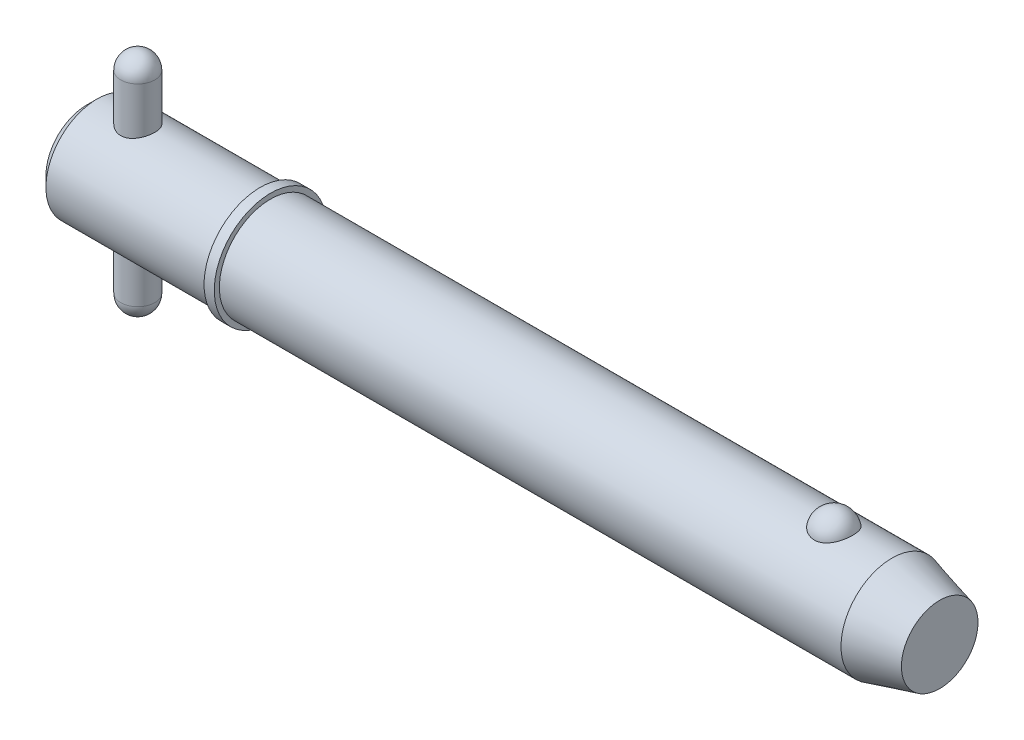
ISO-10303-21;
HEADER;
FILE_DESCRIPTION(('STEP AP214'),'2;1');
FILE_NAME('part.step','',(''),(''),'','','');
FILE_SCHEMA(('AUTOMOTIVE_DESIGN { 1 0 10303 214 1 1 1 1 }'));
ENDSEC;
DATA;
#1=APPLICATION_CONTEXT('core data for automotive mechanical design processes');
#2=APPLICATION_PROTOCOL_DEFINITION('international standard','automotive_design',2000,#1);
#3=PRODUCT_CONTEXT('',#1,'mechanical');
#4=PRODUCT('Part','Part','',(#3));
#5=PRODUCT_RELATED_PRODUCT_CATEGORY('part','',(#4));
#6=PRODUCT_DEFINITION_FORMATION('','',#4);
#7=PRODUCT_DEFINITION_CONTEXT('part definition',#1,'design');
#8=PRODUCT_DEFINITION('design','',#6,#7);
#9=PRODUCT_DEFINITION_SHAPE('','',#8);
#10=(LENGTH_UNIT() NAMED_UNIT(*) SI_UNIT(.MILLI.,.METRE.));
#11=(NAMED_UNIT(*) PLANE_ANGLE_UNIT() SI_UNIT($,.RADIAN.));
#12=(NAMED_UNIT(*) SI_UNIT($,.STERADIAN.) SOLID_ANGLE_UNIT());
#13=UNCERTAINTY_MEASURE_WITH_UNIT(LENGTH_MEASURE(1.E-05),#10,'distance_accuracy_value','');
#14=(GEOMETRIC_REPRESENTATION_CONTEXT(3) GLOBAL_UNCERTAINTY_ASSIGNED_CONTEXT((#13)) GLOBAL_UNIT_ASSIGNED_CONTEXT((#10,
#11,#12)) REPRESENTATION_CONTEXT('',''));
#15=CARTESIAN_POINT('',(0.,0.,0.));
#16=DIRECTION('',(0.,0.,1.));
#17=DIRECTION('',(1.,0.,0.));
#18=AXIS2_PLACEMENT_3D('',#15,#16,#17);
#19=CARTESIAN_POINT('',(7.14,15.875,0.));
#20=DIRECTION('',(0.,-1.,0.));
#21=DIRECTION('',(0.,0.,-1.));
#22=AXIS2_PLACEMENT_3D('',#19,#20,#21);
#23=CYLINDRICAL_SURFACE('',#22,2.38);
#24=CARTESIAN_POINT('',(7.14,-13.495,0.));
#25=DIRECTION('',(0.,-1.,0.));
#26=DIRECTION('',(0.,0.,-1.));
#27=AXIS2_PLACEMENT_3D('',#24,#25,#26);
#28=CIRCLE('',#27,2.38);
#29=CARTESIAN_POINT('',(7.14,-13.495,-2.38));
#30=VERTEX_POINT('',#29);
#31=EDGE_CURVE('P0_E10',#30,#30,#28,.F.);
#32=ORIENTED_EDGE('',*,*,#31,.T.);
#33=EDGE_LOOP('',(#32));
#34=FACE_BOUND('',#33,.T.);
#35=CARTESIAN_POINT('',(7.14,13.495,0.));
#36=DIRECTION('',(0.,-1.,0.));
#37=DIRECTION('',(0.,0.,-1.));
#38=AXIS2_PLACEMENT_3D('',#35,#36,#37);
#39=CIRCLE('',#38,2.38);
#40=CARTESIAN_POINT('',(7.14,13.495,-2.38));
#41=VERTEX_POINT('',#40);
#42=EDGE_CURVE('P0_E21',#41,#41,#39,.T.);
#43=ORIENTED_EDGE('',*,*,#42,.T.);
#44=EDGE_LOOP('',(#43));
#45=FACE_BOUND('',#44,.T.);
#46=ADVANCED_FACE('P0_F14',(#34,#45),#23,.T.);
#47=CARTESIAN_POINT('',(7.14,-13.495,0.));
#48=DIRECTION('',(0.,0.,1.));
#49=DIRECTION('',(1.,0.,0.));
#50=AXIS2_PLACEMENT_3D('',#47,#48,#49);
#51=SPHERICAL_SURFACE('',#50,2.38);
#52=CARTESIAN_POINT('',(7.14,-13.495,0.));
#53=DIRECTION('',(0.,-1.,0.));
#54=DIRECTION('',(0.,0.,-1.));
#55=AXIS2_PLACEMENT_3D('',#52,#53,#54);
#56=SPHERICAL_SURFACE('',#55,2.38);
#57=ORIENTED_EDGE('',*,*,#31,.F.);
#58=EDGE_LOOP('',(#57));
#59=FACE_BOUND('',#58,.T.);
#60=ADVANCED_FACE('P0_F29',(#59),#56,.T.);
#61=CARTESIAN_POINT('',(7.14,13.495,0.));
#62=DIRECTION('',(0.,0.,1.));
#63=DIRECTION('',(1.,0.,0.));
#64=AXIS2_PLACEMENT_3D('',#61,#62,#63);
#65=SPHERICAL_SURFACE('',#64,2.38);
#66=CARTESIAN_POINT('',(7.14,13.495,0.));
#67=DIRECTION('',(0.,-1.,0.));
#68=DIRECTION('',(0.,0.,-1.));
#69=AXIS2_PLACEMENT_3D('',#66,#67,#68);
#70=SPHERICAL_SURFACE('',#69,2.38);
#71=ORIENTED_EDGE('',*,*,#42,.F.);
#72=EDGE_LOOP('',(#71));
#73=FACE_BOUND('',#72,.T.);
#74=ADVANCED_FACE('P0_F16',(#73),#70,.T.);
#75=CLOSED_SHELL('',(#46,#60,#74));
#76=MANIFOLD_SOLID_BREP('P0_B1',#75);
#77=CARTESIAN_POINT('',(0.,0.,0.));
#78=DIRECTION('',(1.,0.,0.));
#79=DIRECTION('',(0.,0.,-1.));
#80=AXIS2_PLACEMENT_3D('',#77,#78,#79);
#81=CYLINDRICAL_SURFACE('',#80,7.145);
#82=CARTESIAN_POINT('',(112.68362424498,0.,0.));
#83=DIRECTION('',(1.,0.,0.));
#84=DIRECTION('',(0.,0.,-1.));
#85=AXIS2_PLACEMENT_3D('',#82,#83,#84);
#86=CIRCLE('',#85,7.145);
#87=CARTESIAN_POINT('',(112.68362424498,0.,-7.145));
#88=VERTEX_POINT('',#87);
#89=EDGE_CURVE('P1_E81',#88,#88,#86,.T.);
#90=ORIENTED_EDGE('',*,*,#89,.F.);
#91=EDGE_LOOP('',(#90));
#92=FACE_BOUND('',#91,.T.);
#93=CARTESIAN_POINT('',(25.7,0.,0.));
#94=DIRECTION('',(1.,0.,0.));
#95=DIRECTION('',(0.,0.,-1.));
#96=AXIS2_PLACEMENT_3D('',#93,#94,#95);
#97=CIRCLE('',#96,7.145);
#98=CARTESIAN_POINT('',(25.7,0.,-7.145));
#99=VERTEX_POINT('',#98);
#100=EDGE_CURVE('P1_E85',#99,#99,#97,.T.);
#101=ORIENTED_EDGE('',*,*,#100,.T.);
#102=EDGE_LOOP('',(#101));
#103=FACE_BOUND('',#102,.T.);
#104=CARTESIAN_POINT('',(104.539503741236,6.60328629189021,2.72903557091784));
#105=CARTESIAN_POINT('',(104.398315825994,6.60329644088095,2.7290249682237));
#106=CARTESIAN_POINT('',(104.256883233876,6.60799490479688,2.71772840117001));
#107=CARTESIAN_POINT('',(103.977955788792,6.62628236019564,2.67281935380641));
#108=CARTESIAN_POINT('',(103.840472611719,6.63989534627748,2.63914664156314));
#109=CARTESIAN_POINT('',(103.573889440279,6.67440775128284,2.55059642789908));
#110=CARTESIAN_POINT('',(103.444768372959,6.69528793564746,2.49577486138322));
#111=CARTESIAN_POINT('',(103.197869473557,6.74205585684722,2.36651799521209));
#112=CARTESIAN_POINT('',(103.080086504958,6.76794130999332,2.29209163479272));
#113=CARTESIAN_POINT('',(102.85516710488,6.82286177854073,2.12312937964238));
#114=CARTESIAN_POINT('',(102.748440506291,6.85196655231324,2.02807107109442));
#115=CARTESIAN_POINT('',(102.551918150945,6.90970232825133,1.82167822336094));
#116=CARTESIAN_POINT('',(102.462127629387,6.93833318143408,1.71033867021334));
#117=CARTESIAN_POINT('',(102.297667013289,6.9935167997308,1.46891951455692));
#118=CARTESIAN_POINT('',(102.223844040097,7.01992110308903,1.33822781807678));
#119=CARTESIAN_POINT('',(102.098088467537,7.06643385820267,1.06566567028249));
#120=CARTESIAN_POINT('',(102.04615735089,7.08654188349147,0.923794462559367));
#121=CARTESIAN_POINT('',(101.964732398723,7.11862399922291,0.630993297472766));
#122=CARTESIAN_POINT('',(101.935516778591,7.13049704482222,0.479974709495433));
#123=CARTESIAN_POINT('',(101.901174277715,7.14449484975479,0.174782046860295));
#124=CARTESIAN_POINT('',(101.896046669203,7.14661990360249,0.0206080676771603));
#125=CARTESIAN_POINT('',(101.909938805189,7.14092465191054,-0.285506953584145));
#126=CARTESIAN_POINT('',(101.928810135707,7.1331654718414,-0.43745589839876));
#127=CARTESIAN_POINT('',(101.990062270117,7.10859076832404,-0.735778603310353));
#128=CARTESIAN_POINT('',(102.032443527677,7.0917750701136,-0.882152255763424));
#129=CARTESIAN_POINT('',(102.139934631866,7.05076716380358,-1.165431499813));
#130=CARTESIAN_POINT('',(102.205075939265,7.02656475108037,-1.30232366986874));
#131=CARTESIAN_POINT('',(102.356759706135,6.97329145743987,-1.56265907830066));
#132=CARTESIAN_POINT('',(102.443303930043,6.94422017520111,-1.68610120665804));
#133=CARTESIAN_POINT('',(102.636465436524,6.88415108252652,-1.91671004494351));
#134=CARTESIAN_POINT('',(102.743180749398,6.85314438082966,-2.02379244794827));
#135=CARTESIAN_POINT('',(102.973974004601,6.79282069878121,-2.21787433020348));
#136=CARTESIAN_POINT('',(103.098050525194,6.76350358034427,-2.30487545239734));
#137=CARTESIAN_POINT('',(103.357678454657,6.71060580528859,-2.45458647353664));
#138=CARTESIAN_POINT('',(103.492938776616,6.68691885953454,-2.51776240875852));
#139=CARTESIAN_POINT('',(103.773277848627,6.64741247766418,-2.62030218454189));
#140=CARTESIAN_POINT('',(103.918352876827,6.63159007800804,-2.65967499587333));
#141=CARTESIAN_POINT('',(104.206347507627,6.61038594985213,-2.71193301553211));
#142=CARTESIAN_POINT('',(104.34900807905,6.60451880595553,-2.72605165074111));
#143=CARTESIAN_POINT('',(104.634800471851,6.60240611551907,-2.73116688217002));
#144=CARTESIAN_POINT('',(104.777932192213,6.60615862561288,-2.7221681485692));
#145=CARTESIAN_POINT('',(105.055848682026,6.6225609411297,-2.68200435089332));
#146=CARTESIAN_POINT('',(105.190754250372,6.63492533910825,-2.65154998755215));
#147=CARTESIAN_POINT('',(105.45332009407,6.66687445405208,-2.57015684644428));
#148=CARTESIAN_POINT('',(105.58097978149,6.68645975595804,-2.51921640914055));
#149=CARTESIAN_POINT('',(105.828577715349,6.73127274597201,-2.39693610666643));
#150=CARTESIAN_POINT('',(105.948287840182,6.7566138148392,-2.32517694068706));
#151=CARTESIAN_POINT('',(106.174159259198,6.81006003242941,-2.16363812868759));
#152=CARTESIAN_POINT('',(106.280317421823,6.83816581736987,-2.07385432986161));
#153=CARTESIAN_POINT('',(106.481862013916,6.89580469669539,-1.87357235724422));
#154=CARTESIAN_POINT('',(106.576440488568,6.92533863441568,-1.76226074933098));
#155=CARTESIAN_POINT('',(106.746332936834,6.98139526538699,-1.52511696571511));
#156=CARTESIAN_POINT('',(106.821643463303,7.0079174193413,-1.39928219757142));
#157=CARTESIAN_POINT('',(106.953595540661,7.05607625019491,-1.1321597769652));
#158=CARTESIAN_POINT('',(107.009568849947,7.07753119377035,-0.990508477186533));
#159=CARTESIAN_POINT('',(107.098296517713,7.11222355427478,-0.699154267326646));
#160=CARTESIAN_POINT('',(107.131050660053,7.12546089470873,-0.549451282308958));
#161=CARTESIAN_POINT('',(107.172689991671,7.1423758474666,-0.24612065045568));
#162=CARTESIAN_POINT('',(107.181558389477,7.14604673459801,-0.0924903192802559));
#163=CARTESIAN_POINT('',(107.175194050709,7.14343510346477,0.214181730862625));
#164=CARTESIAN_POINT('',(107.159961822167,7.13715279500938,0.367223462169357));
#165=CARTESIAN_POINT('',(107.105845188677,7.1153294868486,0.667595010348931));
#166=CARTESIAN_POINT('',(107.067077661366,7.09983424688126,0.814949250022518));
#167=CARTESIAN_POINT('',(106.966770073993,7.06119140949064,1.10063221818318));
#168=CARTESIAN_POINT('',(106.905228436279,7.03804328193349,1.238960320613));
#169=CARTESIAN_POINT('',(106.760207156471,6.98632429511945,1.50352300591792));
#170=CARTESIAN_POINT('',(106.676606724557,6.95772382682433,1.62968561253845));
#171=CARTESIAN_POINT('',(106.48938046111,6.89823072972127,1.86554304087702));
#172=CARTESIAN_POINT('',(106.385755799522,6.86733823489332,1.97523882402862));
#173=CARTESIAN_POINT('',(106.161076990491,6.80676456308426,2.17482293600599));
#174=CARTESIAN_POINT('',(106.040067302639,6.7770805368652,2.26476035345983));
#175=CARTESIAN_POINT('',(105.783340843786,6.7223050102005,2.42252989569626));
#176=CARTESIAN_POINT('',(105.64761851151,6.69721525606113,2.49035362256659));
#177=CARTESIAN_POINT('',(105.370402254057,6.65552591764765,2.59967646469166));
#178=CARTESIAN_POINT('',(105.229281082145,6.63865794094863,2.64202017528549));
#179=CARTESIAN_POINT('',(104.941444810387,6.61425039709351,2.7025584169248));
#180=CARTESIAN_POINT('',(104.794748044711,6.606682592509,2.72082606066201));
#181=CARTESIAN_POINT('',(104.611679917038,6.60358754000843,2.72830331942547));
#182=CARTESIAN_POINT('',(104.575599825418,6.60328369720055,2.72903828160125));
#183=CARTESIAN_POINT('',(104.539503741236,6.60328629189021,2.72903557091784));
#184=B_SPLINE_CURVE_WITH_KNOTS('',3,(#104,#105,#106,#107,#108,#109,#110,#111,#112,#113,#114,
#115,#116,#117,#118,#119,#120,#121,#122,#123,#124,#125,#126,#127,#128,#129,#130,#131,#132,#133,
#134,#135,#136,#137,#138,#139,#140,#141,#142,#143,#144,#145,#146,#147,#148,#149,#150,#151,#152,
#153,#154,#155,#156,#157,#158,#159,#160,#161,#162,#163,#164,#165,#166,#167,#168,#169,#170,#171,
#172,#173,#174,#175,#176,#177,#178,#179,#180,#181,#182,#183),.UNSPECIFIED.,.T.,.F.,(4,2,2,2,2,2,
2,2,2,2,2,2,2,2,2,2,2,2,2,2,2,2,2,2,2,2,2,2,2,2,2,2,2,2,2,2,2,2,2,4),(0.,0.423468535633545,
0.848081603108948,1.27157926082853,1.69488414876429,2.13051395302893,2.56627819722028,
3.02136706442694,3.47648674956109,3.93709649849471,4.39769233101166,4.85545355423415,
5.31322361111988,5.77162895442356,6.23007210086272,6.69080337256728,7.15149693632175,
7.60264329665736,8.05361952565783,8.4818972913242,8.91008854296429,9.32472524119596,
9.73939553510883,10.1630783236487,10.5868588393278,11.0319070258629,11.4770347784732,
11.9362874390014,12.3955443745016,12.8551240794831,13.3146940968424,13.7720003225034,
14.2293382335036,14.6892343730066,15.1491036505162,15.6078171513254,16.0667046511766,
16.5093965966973,16.9507410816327,17.0590049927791),.UNSPECIFIED.);
#185=CARTESIAN_POINT('',(104.539503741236,6.60328629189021,2.72903557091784));
#186=VERTEX_POINT('',#185);
#187=EDGE_CURVE('P1_E35',#186,#186,#184,.T.);
#188=ORIENTED_EDGE('',*,*,#187,.T.);
#189=EDGE_LOOP('',(#188));
#190=FACE_BOUND('',#189,.T.);
#191=ADVANCED_FACE('P1_F13',(#92,#103,#190),#81,.T.);
#192=CARTESIAN_POINT('',(0.,0.,0.));
#193=DIRECTION('',(-1.,0.,0.));
#194=DIRECTION('',(0.,0.,1.));
#195=AXIS2_PLACEMENT_3D('',#192,#193,#194);
#196=PLANE('',#195);
#197=CARTESIAN_POINT('',(0.,0.,0.));
#198=DIRECTION('',(1.,0.,0.));
#199=DIRECTION('',(0.,0.,-1.));
#200=AXIS2_PLACEMENT_3D('',#197,#198,#199);
#201=CIRCLE('',#200,5.716);
#202=CARTESIAN_POINT('',(0.,0.,-5.716));
#203=VERTEX_POINT('',#202);
#204=EDGE_CURVE('P1_E9',#203,#203,#201,.T.);
#205=ORIENTED_EDGE('',*,*,#204,.F.);
#206=EDGE_LOOP('',(#205));
#207=FACE_BOUND('',#206,.T.);
#208=ADVANCED_FACE('P1_F15',(#207),#196,.T.);
#209=CARTESIAN_POINT('',(1.42899999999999,0.,0.));
#210=DIRECTION('',(1.,0.,0.));
#211=DIRECTION('',(0.,0.,-1.));
#212=AXIS2_PLACEMENT_3D('',#209,#210,#211);
#213=CONICAL_SURFACE('',#212,7.145,0.78539816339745);
#214=ORIENTED_EDGE('',*,*,#204,.T.);
#215=EDGE_LOOP('',(#214));
#216=FACE_BOUND('',#215,.T.);
#217=CARTESIAN_POINT('',(1.42899999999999,0.,0.));
#218=DIRECTION('',(1.,0.,0.));
#219=DIRECTION('',(0.,0.,-1.));
#220=AXIS2_PLACEMENT_3D('',#217,#218,#219);
#221=CIRCLE('',#220,7.145);
#222=CARTESIAN_POINT('',(1.42899999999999,0.,-7.145));
#223=VERTEX_POINT('',#222);
#224=EDGE_CURVE('P1_E26',#223,#223,#221,.T.);
#225=ORIENTED_EDGE('',*,*,#224,.F.);
#226=EDGE_LOOP('',(#225));
#227=FACE_BOUND('',#226,.T.);
#228=ADVANCED_FACE('P1_F77',(#216,#227),#213,.T.);
#229=CARTESIAN_POINT('',(0.,0.,0.));
#230=DIRECTION('',(1.,0.,0.));
#231=DIRECTION('',(0.,0.,-1.));
#232=AXIS2_PLACEMENT_3D('',#229,#230,#231);
#233=CYLINDRICAL_SURFACE('',#232,7.145);
#234=CARTESIAN_POINT('',(7.14,-6.73695962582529,2.38));
#235=CARTESIAN_POINT('',(7.01035997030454,-6.73695921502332,2.38000059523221));
#236=CARTESIAN_POINT('',(6.88072348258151,-6.74074253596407,2.36937183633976));
#237=CARTESIAN_POINT('',(6.62529075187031,-6.75538853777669,2.32728080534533));
#238=CARTESIAN_POINT('',(6.49949514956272,-6.76625239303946,2.29581507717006));
#239=CARTESIAN_POINT('',(6.2554858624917,-6.79369535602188,2.21327763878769));
#240=CARTESIAN_POINT('',(6.13725786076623,-6.81026326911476,2.16224430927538));
#241=CARTESIAN_POINT('',(5.91100349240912,-6.84723128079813,2.04215132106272));
#242=CARTESIAN_POINT('',(5.80297937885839,-6.86763222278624,1.97308769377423));
#243=CARTESIAN_POINT('',(5.59597854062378,-6.91086152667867,1.81600414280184));
#244=CARTESIAN_POINT('',(5.49745861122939,-6.93375032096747,1.72739874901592));
#245=CARTESIAN_POINT('',(5.31636508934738,-6.97886546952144,1.53499636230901));
#246=CARTESIAN_POINT('',(5.23379405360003,-7.00109171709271,1.43119693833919));
#247=CARTESIAN_POINT('',(5.08487013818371,-7.04307708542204,1.20801318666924));
#248=CARTESIAN_POINT('',(5.01899578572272,-7.06275685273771,1.08829330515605));
#249=CARTESIAN_POINT('',(4.90850130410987,-7.09671988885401,0.838703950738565));
#250=CARTESIAN_POINT('',(4.86387545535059,-7.11100460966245,0.70883722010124));
#251=CARTESIAN_POINT('',(4.79869354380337,-7.13213998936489,0.44742990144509));
#252=CARTESIAN_POINT('',(4.77735497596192,-7.13923172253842,0.316104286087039));
#253=CARTESIAN_POINT('',(4.75686536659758,-7.14603777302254,0.0515578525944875));
#254=CARTESIAN_POINT('',(4.75770861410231,-7.14575398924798,-0.0816624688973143));
#255=CARTESIAN_POINT('',(4.78106216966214,-7.13800438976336,-0.340678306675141));
#256=CARTESIAN_POINT('',(4.80272255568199,-7.13082030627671,-0.466560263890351));
#257=CARTESIAN_POINT('',(4.86569013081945,-7.11043095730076,-0.712788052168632));
#258=CARTESIAN_POINT('',(4.90699865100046,-7.09722528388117,-0.833133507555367));
#259=CARTESIAN_POINT('',(5.00858673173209,-7.06591754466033,-1.06673173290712));
#260=CARTESIAN_POINT('',(5.06910834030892,-7.0477534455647,-1.17987058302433));
#261=CARTESIAN_POINT('',(5.20720514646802,-7.00841977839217,-1.39463797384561));
#262=CARTESIAN_POINT('',(5.28478508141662,-6.987249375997,-1.49626330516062));
#263=CARTESIAN_POINT('',(5.4590800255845,-6.94296010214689,-1.69017445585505));
#264=CARTESIAN_POINT('',(5.55652324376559,-6.91979641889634,-1.78179645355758));
#265=CARTESIAN_POINT('',(5.76558873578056,-6.87497076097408,-1.94761348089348));
#266=CARTESIAN_POINT('',(5.87721318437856,-6.85330901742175,-2.02180583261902));
#267=CARTESIAN_POINT('',(6.11357367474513,-6.81369485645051,-2.15157488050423));
#268=CARTESIAN_POINT('',(6.23847358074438,-6.79579956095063,-2.20687188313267));
#269=CARTESIAN_POINT('',(6.49655785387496,-6.76640630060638,-2.29542443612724));
#270=CARTESIAN_POINT('',(6.62973872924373,-6.75490565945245,-2.32868920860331));
#271=CARTESIAN_POINT('',(6.89417536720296,-6.74020933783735,-2.37088225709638));
#272=CARTESIAN_POINT('',(7.02524746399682,-6.73666278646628,-2.38083959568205));
#273=CARTESIAN_POINT('',(7.28721035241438,-6.73729555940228,-2.37904974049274));
#274=CARTESIAN_POINT('',(7.41810117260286,-6.7414734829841,-2.36730648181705));
#275=CARTESIAN_POINT('',(7.67130717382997,-6.75673471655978,-2.32337336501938));
#276=CARTESIAN_POINT('',(7.79376251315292,-6.76757635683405,-2.29189834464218));
#277=CARTESIAN_POINT('',(8.03162917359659,-6.79467771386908,-2.21025275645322));
#278=CARTESIAN_POINT('',(8.14703924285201,-6.8109383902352,-2.16007887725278));
#279=CARTESIAN_POINT('',(8.37159169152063,-6.84768362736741,-2.04065289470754));
#280=CARTESIAN_POINT('',(8.48041962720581,-6.86828569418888,-1.97084668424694));
#281=CARTESIAN_POINT('',(8.68518919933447,-6.91116416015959,-1.8147657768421));
#282=CARTESIAN_POINT('',(8.78112702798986,-6.93344105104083,-1.72848623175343));
#283=CARTESIAN_POINT('',(8.96215574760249,-6.97845348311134,-1.53698616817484));
#284=CARTESIAN_POINT('',(9.04650427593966,-7.00115965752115,-1.43105491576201));
#285=CARTESIAN_POINT('',(9.19627592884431,-7.04341676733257,-1.20598377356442));
#286=CARTESIAN_POINT('',(9.26169972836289,-7.06296781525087,-1.08684435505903));
#287=CARTESIAN_POINT('',(9.37116617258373,-7.0966205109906,-0.83933303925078));
#288=CARTESIAN_POINT('',(9.41534821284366,-7.11075755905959,-0.711027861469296));
#289=CARTESIAN_POINT('',(9.48132660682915,-7.13214194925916,-0.448245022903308));
#290=CARTESIAN_POINT('',(9.50313102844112,-7.13939177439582,-0.313769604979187));
#291=CARTESIAN_POINT('',(9.5230098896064,-7.14599771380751,-0.049254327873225));
#292=CARTESIAN_POINT('',(9.52215013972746,-7.14570837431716,0.0806974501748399));
#293=CARTESIAN_POINT('',(9.49935359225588,-7.13814116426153,0.338518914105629));
#294=CARTESIAN_POINT('',(9.47741850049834,-7.13086385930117,0.466388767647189));
#295=CARTESIAN_POINT('',(9.4138005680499,-7.11026814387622,0.714400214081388));
#296=CARTESIAN_POINT('',(9.37243609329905,-7.09704726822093,0.834632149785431));
#297=CARTESIAN_POINT('',(9.27142829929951,-7.06592602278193,1.06649582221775));
#298=CARTESIAN_POINT('',(9.2117816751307,-7.04802480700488,1.1781259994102));
#299=CARTESIAN_POINT('',(9.07336776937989,-7.00856499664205,1.39411030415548));
#300=CARTESIAN_POINT('',(8.99397590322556,-6.98689577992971,1.49804368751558));
#301=CARTESIAN_POINT('',(8.81938810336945,-6.9426110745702,1.69146078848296));
#302=CARTESIAN_POINT('',(8.72418713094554,-6.91999528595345,1.78093988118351));
#303=CARTESIAN_POINT('',(8.51623540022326,-6.87531507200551,1.94646188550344));
#304=CARTESIAN_POINT('',(8.4029442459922,-6.85330672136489,2.02184316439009));
#305=CARTESIAN_POINT('',(8.16461714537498,-6.81342065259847,2.1524427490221));
#306=CARTESIAN_POINT('',(8.03958429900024,-6.7955418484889,2.20766635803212));
#307=CARTESIAN_POINT('',(7.78712566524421,-6.76686117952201,2.29403636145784));
#308=CARTESIAN_POINT('',(7.66006989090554,-6.75577342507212,2.32616709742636));
#309=CARTESIAN_POINT('',(7.40200728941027,-6.74082409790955,2.36914495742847));
#310=CARTESIAN_POINT('',(7.27100183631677,-6.73696004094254,2.37999939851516));
#311=CARTESIAN_POINT('',(7.14,-6.73695962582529,2.38));
#312=B_SPLINE_CURVE_WITH_KNOTS('',3,(#234,#235,#236,#237,#238,#239,#240,#241,#242,#243,#244,
#245,#246,#247,#248,#249,#250,#251,#252,#253,#254,#255,#256,#257,#258,#259,#260,#261,#262,#263,
#264,#265,#266,#267,#268,#269,#270,#271,#272,#273,#274,#275,#276,#277,#278,#279,#280,#281,#282,
#283,#284,#285,#286,#287,#288,#289,#290,#291,#292,#293,#294,#295,#296,#297,#298,#299,#300,#301,
#302,#303,#304,#305,#306,#307,#308,#309,#310,#311),.UNSPECIFIED.,.T.,.F.,(4,2,2,2,2,2,2,2,2,2,2,
2,2,2,2,2,2,2,2,2,2,2,2,2,2,2,2,2,2,2,2,2,2,2,2,2,2,2,4),(0.,0.388434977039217,
0.776934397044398,1.16467566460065,1.55250234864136,1.9540847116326,2.35573139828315,
2.76784120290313,3.17984001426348,3.57752248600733,3.97510257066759,4.35711073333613,
4.7391447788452,5.12619663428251,5.51335611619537,5.91871976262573,6.3241456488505,
6.73533623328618,7.14635459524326,7.53885245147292,7.93127914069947,8.31025106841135,
8.68929014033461,9.08033871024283,9.47150254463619,9.88145528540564,10.2913934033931,
10.6986033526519,11.1056664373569,11.4936225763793,11.8815473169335,12.2633262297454,
12.645174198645,13.0411187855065,13.437189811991,13.8487371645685,14.2601761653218,
14.6528265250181,15.0453418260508),.UNSPECIFIED.);
#313=CARTESIAN_POINT('',(7.14,-6.73695962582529,2.38));
#314=VERTEX_POINT('',#313);
#315=EDGE_CURVE('P1_E17',#314,#314,#312,.T.);
#316=ORIENTED_EDGE('',*,*,#315,.F.);
#317=EDGE_LOOP('',(#316));
#318=FACE_BOUND('',#317,.T.);
#319=CARTESIAN_POINT('',(7.14,6.73695962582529,2.38));
#320=CARTESIAN_POINT('',(7.26964002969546,6.73695921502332,2.38000059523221));
#321=CARTESIAN_POINT('',(7.39927651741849,6.74074253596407,2.36937183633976));
#322=CARTESIAN_POINT('',(7.65470924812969,6.75538853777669,2.32728080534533));
#323=CARTESIAN_POINT('',(7.78050485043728,6.76625239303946,2.29581507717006));
#324=CARTESIAN_POINT('',(8.02451413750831,6.79369535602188,2.21327763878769));
#325=CARTESIAN_POINT('',(8.14274213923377,6.81026326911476,2.16224430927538));
#326=CARTESIAN_POINT('',(8.36899650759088,6.84723128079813,2.04215132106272));
#327=CARTESIAN_POINT('',(8.47702062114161,6.86763222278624,1.97308769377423));
#328=CARTESIAN_POINT('',(8.68402145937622,6.91086152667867,1.81600414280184));
#329=CARTESIAN_POINT('',(8.78254138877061,6.93375032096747,1.72739874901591));
#330=CARTESIAN_POINT('',(8.96363491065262,6.97886546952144,1.53499636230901));
#331=CARTESIAN_POINT('',(9.04620594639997,7.00109171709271,1.43119693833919));
#332=CARTESIAN_POINT('',(9.19512986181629,7.04307708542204,1.20801318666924));
#333=CARTESIAN_POINT('',(9.26100421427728,7.06275685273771,1.08829330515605));
#334=CARTESIAN_POINT('',(9.37149869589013,7.09671988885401,0.838703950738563));
#335=CARTESIAN_POINT('',(9.41612454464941,7.11100460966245,0.708837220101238));
#336=CARTESIAN_POINT('',(9.48130645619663,7.13213998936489,0.447429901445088));
#337=CARTESIAN_POINT('',(9.50264502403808,7.13923172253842,0.316104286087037));
#338=CARTESIAN_POINT('',(9.52313463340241,7.14603777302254,0.0515578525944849));
#339=CARTESIAN_POINT('',(9.52229138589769,7.14575398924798,-0.0816624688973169));
#340=CARTESIAN_POINT('',(9.49893783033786,7.13800438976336,-0.340678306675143));
#341=CARTESIAN_POINT('',(9.47727744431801,7.13082030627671,-0.466560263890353));
#342=CARTESIAN_POINT('',(9.41430986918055,7.11043095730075,-0.712788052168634));
#343=CARTESIAN_POINT('',(9.37300134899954,7.09722528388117,-0.833133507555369));
#344=CARTESIAN_POINT('',(9.27141326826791,7.06591754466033,-1.06673173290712));
#345=CARTESIAN_POINT('',(9.21089165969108,7.0477534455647,-1.17987058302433));
#346=CARTESIAN_POINT('',(9.07279485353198,7.00841977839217,-1.39463797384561));
#347=CARTESIAN_POINT('',(8.99521491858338,6.987249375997,-1.49626330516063));
#348=CARTESIAN_POINT('',(8.82091997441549,6.94296010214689,-1.69017445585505));
#349=CARTESIAN_POINT('',(8.72347675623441,6.91979641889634,-1.78179645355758));
#350=CARTESIAN_POINT('',(8.51441126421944,6.87497076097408,-1.94761348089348));
#351=CARTESIAN_POINT('',(8.40278681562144,6.85330901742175,-2.02180583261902));
#352=CARTESIAN_POINT('',(8.16642632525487,6.81369485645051,-2.15157488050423));
#353=CARTESIAN_POINT('',(8.04152641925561,6.79579956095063,-2.20687188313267));
#354=CARTESIAN_POINT('',(7.78344214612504,6.76640630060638,-2.29542443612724));
#355=CARTESIAN_POINT('',(7.65026127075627,6.75490565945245,-2.32868920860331));
#356=CARTESIAN_POINT('',(7.38582463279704,6.74020933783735,-2.37088225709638));
#357=CARTESIAN_POINT('',(7.25475253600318,6.73666278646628,-2.38083959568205));
#358=CARTESIAN_POINT('',(6.99278964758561,6.73729555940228,-2.37904974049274));
#359=CARTESIAN_POINT('',(6.86189882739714,6.7414734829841,-2.36730648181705));
#360=CARTESIAN_POINT('',(6.60869282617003,6.75673471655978,-2.32337336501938));
#361=CARTESIAN_POINT('',(6.48623748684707,6.76757635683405,-2.29189834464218));
#362=CARTESIAN_POINT('',(6.2483708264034,6.79467771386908,-2.21025275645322));
#363=CARTESIAN_POINT('',(6.13296075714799,6.8109383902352,-2.16007887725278));
#364=CARTESIAN_POINT('',(5.90840830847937,6.84768362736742,-2.04065289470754));
#365=CARTESIAN_POINT('',(5.79958037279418,6.86828569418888,-1.97084668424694));
#366=CARTESIAN_POINT('',(5.59481080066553,6.91116416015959,-1.8147657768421));
#367=CARTESIAN_POINT('',(5.49887297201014,6.93344105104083,-1.72848623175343));
#368=CARTESIAN_POINT('',(5.31784425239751,6.97845348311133,-1.53698616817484));
#369=CARTESIAN_POINT('',(5.23349572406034,7.00115965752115,-1.43105491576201));
#370=CARTESIAN_POINT('',(5.08372407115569,7.04341676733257,-1.20598377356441));
#371=CARTESIAN_POINT('',(5.01830027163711,7.06296781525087,-1.08684435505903));
#372=CARTESIAN_POINT('',(4.90883382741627,7.0966205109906,-0.839333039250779));
#373=CARTESIAN_POINT('',(4.86465178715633,7.11075755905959,-0.711027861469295));
#374=CARTESIAN_POINT('',(4.79867339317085,7.13214194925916,-0.448245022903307));
#375=CARTESIAN_POINT('',(4.77686897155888,7.13939177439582,-0.313769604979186));
#376=CARTESIAN_POINT('',(4.7569901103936,7.14599771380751,-0.0492543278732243));
#377=CARTESIAN_POINT('',(4.75784986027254,7.14570837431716,0.0806974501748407));
#378=CARTESIAN_POINT('',(4.78064640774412,7.13814116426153,0.33851891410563));
#379=CARTESIAN_POINT('',(4.80258149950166,7.13086385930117,0.46638876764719));
#380=CARTESIAN_POINT('',(4.8661994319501,7.11026814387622,0.714400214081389));
#381=CARTESIAN_POINT('',(4.90756390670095,7.09704726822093,0.834632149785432));
#382=CARTESIAN_POINT('',(5.00857170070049,7.06592602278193,1.06649582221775));
#383=CARTESIAN_POINT('',(5.0682183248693,7.04802480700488,1.1781259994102));
#384=CARTESIAN_POINT('',(5.20663223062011,7.00856499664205,1.39411030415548));
#385=CARTESIAN_POINT('',(5.28602409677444,6.98689577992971,1.49804368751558));
#386=CARTESIAN_POINT('',(5.46061189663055,6.9426110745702,1.69146078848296));
#387=CARTESIAN_POINT('',(5.55581286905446,6.91999528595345,1.78093988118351));
#388=CARTESIAN_POINT('',(5.76376459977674,6.87531507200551,1.94646188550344));
#389=CARTESIAN_POINT('',(5.8770557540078,6.85330672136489,2.02184316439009));
#390=CARTESIAN_POINT('',(6.11538285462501,6.81342065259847,2.1524427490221));
#391=CARTESIAN_POINT('',(6.24041570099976,6.7955418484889,2.20766635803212));
#392=CARTESIAN_POINT('',(6.4928743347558,6.76686117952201,2.29403636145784));
#393=CARTESIAN_POINT('',(6.61993010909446,6.75577342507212,2.32616709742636));
#394=CARTESIAN_POINT('',(6.87799271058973,6.74082409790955,2.36914495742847));
#395=CARTESIAN_POINT('',(7.00899816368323,6.73696004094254,2.37999939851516));
#396=CARTESIAN_POINT('',(7.14,6.73695962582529,2.38));
#397=B_SPLINE_CURVE_WITH_KNOTS('',3,(#319,#320,#321,#322,#323,#324,#325,#326,#327,#328,#329,
#330,#331,#332,#333,#334,#335,#336,#337,#338,#339,#340,#341,#342,#343,#344,#345,#346,#347,#348,
#349,#350,#351,#352,#353,#354,#355,#356,#357,#358,#359,#360,#361,#362,#363,#364,#365,#366,#367,
#368,#369,#370,#371,#372,#373,#374,#375,#376,#377,#378,#379,#380,#381,#382,#383,#384,#385,#386,
#387,#388,#389,#390,#391,#392,#393,#394,#395,#396),.UNSPECIFIED.,.T.,.F.,(4,2,2,2,2,2,2,2,2,2,2,
2,2,2,2,2,2,2,2,2,2,2,2,2,2,2,2,2,2,2,2,2,2,2,2,2,2,2,4),(0.,0.388434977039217,
0.776934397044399,1.16467566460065,1.55250234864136,1.9540847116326,2.35573139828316,
2.76784120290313,3.17984001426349,3.57752248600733,3.97510257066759,4.35711073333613,
4.73914477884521,5.12619663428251,5.51335611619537,5.91871976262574,6.3241456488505,
6.73533623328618,7.14635459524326,7.53885245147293,7.93127914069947,8.31025106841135,
8.68929014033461,9.08033871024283,9.47150254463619,9.88145528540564,10.2913934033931,
10.6986033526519,11.1056664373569,11.4936225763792,11.8815473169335,12.2633262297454,
12.645174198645,13.0411187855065,13.437189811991,13.8487371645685,14.2601761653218,
14.6528265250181,15.0453418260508),.UNSPECIFIED.);
#398=CARTESIAN_POINT('',(7.14,6.73695962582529,2.38));
#399=VERTEX_POINT('',#398);
#400=EDGE_CURVE('P1_E43',#399,#399,#397,.T.);
#401=ORIENTED_EDGE('',*,*,#400,.F.);
#402=EDGE_LOOP('',(#401));
#403=FACE_BOUND('',#402,.T.);
#404=ORIENTED_EDGE('',*,*,#224,.T.);
#405=EDGE_LOOP('',(#404));
#406=FACE_BOUND('',#405,.T.);
#407=CARTESIAN_POINT('',(24.271,0.,0.));
#408=DIRECTION('',(1.,0.,0.));
#409=DIRECTION('',(0.,0.,-1.));
#410=AXIS2_PLACEMENT_3D('',#407,#408,#409);
#411=CIRCLE('',#410,7.145);
#412=CARTESIAN_POINT('',(24.271,0.,-7.145));
#413=VERTEX_POINT('',#412);
#414=EDGE_CURVE('P1_E31',#413,#413,#411,.T.);
#415=ORIENTED_EDGE('',*,*,#414,.F.);
#416=EDGE_LOOP('',(#415));
#417=FACE_BOUND('',#416,.T.);
#418=ADVANCED_FACE('P1_F103',(#318,#403,#406,#417),#233,.T.);
#419=CARTESIAN_POINT('',(24.271,7.145,0.));
#420=DIRECTION('',(-1.,0.,0.));
#421=DIRECTION('',(0.,0.,1.));
#422=AXIS2_PLACEMENT_3D('',#419,#420,#421);
#423=PLANE('',#422);
#424=ORIENTED_EDGE('',*,*,#414,.T.);
#425=EDGE_LOOP('',(#424));
#426=FACE_BOUND('',#425,.T.);
#427=CARTESIAN_POINT('',(24.271,0.,0.));
#428=DIRECTION('',(1.,0.,0.));
#429=DIRECTION('',(0.,0.,-1.));
#430=AXIS2_PLACEMENT_3D('',#427,#428,#429);
#431=CIRCLE('',#430,7.8595);
#432=CARTESIAN_POINT('',(24.271,0.,-7.8595));
#433=VERTEX_POINT('',#432);
#434=EDGE_CURVE('P1_E91',#433,#433,#431,.T.);
#435=ORIENTED_EDGE('',*,*,#434,.F.);
#436=EDGE_LOOP('',(#435));
#437=FACE_BOUND('',#436,.T.);
#438=ADVANCED_FACE('P1_F100',(#426,#437),#423,.T.);
#439=CARTESIAN_POINT('',(0.,0.,0.));
#440=DIRECTION('',(1.,0.,0.));
#441=DIRECTION('',(0.,0.,-1.));
#442=AXIS2_PLACEMENT_3D('',#439,#440,#441);
#443=CYLINDRICAL_SURFACE('',#442,7.8595);
#444=ORIENTED_EDGE('',*,*,#434,.T.);
#445=EDGE_LOOP('',(#444));
#446=FACE_BOUND('',#445,.T.);
#447=CARTESIAN_POINT('',(25.7,0.,0.));
#448=DIRECTION('',(1.,0.,0.));
#449=DIRECTION('',(0.,0.,-1.));
#450=AXIS2_PLACEMENT_3D('',#447,#448,#449);
#451=CIRCLE('',#450,7.8595);
#452=CARTESIAN_POINT('',(25.7,0.,-7.8595));
#453=VERTEX_POINT('',#452);
#454=EDGE_CURVE('P1_E88',#453,#453,#451,.T.);
#455=ORIENTED_EDGE('',*,*,#454,.F.);
#456=EDGE_LOOP('',(#455));
#457=FACE_BOUND('',#456,.T.);
#458=ADVANCED_FACE('P1_F68',(#446,#457),#443,.T.);
#459=CARTESIAN_POINT('',(25.7,7.8595,0.));
#460=DIRECTION('',(1.,0.,0.));
#461=DIRECTION('',(0.,0.,-1.));
#462=AXIS2_PLACEMENT_3D('',#459,#460,#461);
#463=PLANE('',#462);
#464=ORIENTED_EDGE('',*,*,#454,.T.);
#465=EDGE_LOOP('',(#464));
#466=FACE_BOUND('',#465,.T.);
#467=ORIENTED_EDGE('',*,*,#100,.F.);
#468=EDGE_LOOP('',(#467));
#469=FACE_BOUND('',#468,.T.);
#470=ADVANCED_FACE('P1_F62',(#466,#469),#463,.T.);
#471=CARTESIAN_POINT('',(119.35,0.,0.));
#472=DIRECTION('',(-1.,0.,0.));
#473=DIRECTION('',(0.,0.,1.));
#474=AXIS2_PLACEMENT_3D('',#471,#472,#473);
#475=CONICAL_SURFACE('',#474,5.35875000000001,0.26179938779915);
#476=ORIENTED_EDGE('',*,*,#89,.T.);
#477=EDGE_LOOP('',(#476));
#478=FACE_BOUND('',#477,.T.);
#479=CARTESIAN_POINT('',(119.35,0.,0.));
#480=DIRECTION('',(1.,0.,0.));
#481=DIRECTION('',(0.,0.,-1.));
#482=AXIS2_PLACEMENT_3D('',#479,#480,#481);
#483=CIRCLE('',#482,5.35875000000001);
#484=CARTESIAN_POINT('',(119.35,0.,-5.35875000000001));
#485=VERTEX_POINT('',#484);
#486=EDGE_CURVE('P1_E42',#485,#485,#483,.T.);
#487=ORIENTED_EDGE('',*,*,#486,.F.);
#488=EDGE_LOOP('',(#487));
#489=FACE_BOUND('',#488,.T.);
#490=ADVANCED_FACE('P1_F59',(#478,#489),#475,.T.);
#491=CARTESIAN_POINT('',(119.35,5.35875000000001,0.));
#492=DIRECTION('',(1.,0.,0.));
#493=DIRECTION('',(0.,0.,-1.));
#494=AXIS2_PLACEMENT_3D('',#491,#492,#493);
#495=PLANE('',#494);
#496=ORIENTED_EDGE('',*,*,#486,.T.);
#497=EDGE_LOOP('',(#496));
#498=FACE_BOUND('',#497,.T.);
#499=ADVANCED_FACE('P1_F55',(#498),#495,.T.);
#500=CARTESIAN_POINT('',(104.539503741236,6.4305,0.));
#501=DIRECTION('',(-1.,0.,0.));
#502=DIRECTION('',(0.,-1.,0.));
#503=AXIS2_PLACEMENT_3D('',#500,#501,#502);
#504=SPHERICAL_SURFACE('',#503,2.7345);
#505=ORIENTED_EDGE('',*,*,#187,.F.);
#506=EDGE_LOOP('',(#505));
#507=FACE_BOUND('',#506,.T.);
#508=ADVANCED_FACE('P1_F50',(#507),#504,.T.);
#509=CARTESIAN_POINT('',(7.14,-7.8595,0.));
#510=DIRECTION('',(0.,1.,0.));
#511=DIRECTION('',(0.,0.,1.));
#512=AXIS2_PLACEMENT_3D('',#509,#510,#511);
#513=CYLINDRICAL_SURFACE('',#512,2.38);
#514=ORIENTED_EDGE('',*,*,#315,.T.);
#515=EDGE_LOOP('',(#514));
#516=FACE_BOUND('',#515,.T.);
#517=ORIENTED_EDGE('',*,*,#400,.T.);
#518=EDGE_LOOP('',(#517));
#519=FACE_BOUND('',#518,.T.);
#520=ADVANCED_FACE('P1_F54',(#516,#519),#513,.F.);
#521=CLOSED_SHELL('',(#191,#208,#228,#418,#438,#458,#470,#490,#499,#508,#520));
#522=MANIFOLD_SOLID_BREP('P1_B1',#521);
#523=ADVANCED_BREP_SHAPE_REPRESENTATION('',(#18,#76,#522),#14);
#524=SHAPE_DEFINITION_REPRESENTATION(#9,#523);
ENDSEC;
END-ISO-10303-21;
